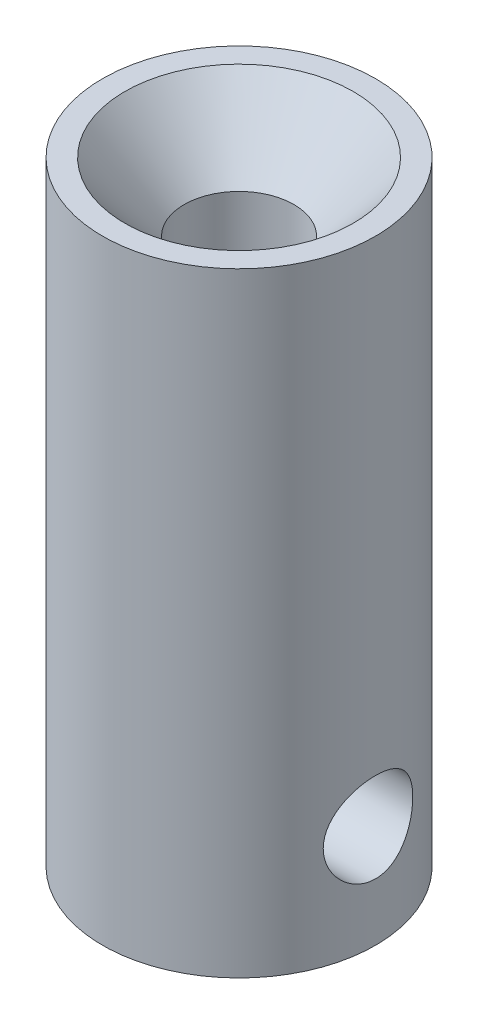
ISO-10303-21;
HEADER;
FILE_DESCRIPTION(('STEP AP214'),'2;1');
FILE_NAME('part.step','',(''),(''),'','','');
FILE_SCHEMA(('AUTOMOTIVE_DESIGN { 1 0 10303 214 1 1 1 1 }'));
ENDSEC;
DATA;
#1=APPLICATION_CONTEXT('core data for automotive mechanical design processes');
#2=APPLICATION_PROTOCOL_DEFINITION('international standard','automotive_design',2000,#1);
#3=PRODUCT_CONTEXT('',#1,'mechanical');
#4=PRODUCT('Part','Part','',(#3));
#5=PRODUCT_RELATED_PRODUCT_CATEGORY('part','',(#4));
#6=PRODUCT_DEFINITION_FORMATION('','',#4);
#7=PRODUCT_DEFINITION_CONTEXT('part definition',#1,'design');
#8=PRODUCT_DEFINITION('design','',#6,#7);
#9=PRODUCT_DEFINITION_SHAPE('','',#8);
#10=(LENGTH_UNIT() NAMED_UNIT(*) SI_UNIT(.MILLI.,.METRE.));
#11=(NAMED_UNIT(*) PLANE_ANGLE_UNIT() SI_UNIT($,.RADIAN.));
#12=(NAMED_UNIT(*) SI_UNIT($,.STERADIAN.) SOLID_ANGLE_UNIT());
#13=UNCERTAINTY_MEASURE_WITH_UNIT(LENGTH_MEASURE(1.E-05),#10,'distance_accuracy_value','');
#14=(GEOMETRIC_REPRESENTATION_CONTEXT(3) GLOBAL_UNCERTAINTY_ASSIGNED_CONTEXT((#13)) GLOBAL_UNIT_ASSIGNED_CONTEXT((#10,
#11,#12)) REPRESENTATION_CONTEXT('',''));
#15=CARTESIAN_POINT('',(0.,0.,0.));
#16=DIRECTION('',(0.,0.,1.));
#17=DIRECTION('',(1.,0.,0.));
#18=AXIS2_PLACEMENT_3D('',#15,#16,#17);
#19=CARTESIAN_POINT('',(0.,0.,0.));
#20=DIRECTION('',(0.,-1.,0.));
#21=DIRECTION('',(0.,0.,-1.));
#22=AXIS2_PLACEMENT_3D('',#19,#20,#21);
#23=CYLINDRICAL_SURFACE('',#22,2.5527);
#24=CARTESIAN_POINT('',(0.,19.05,0.));
#25=DIRECTION('',(0.,-1.,0.));
#26=DIRECTION('',(0.,0.,-1.));
#27=AXIS2_PLACEMENT_3D('',#24,#25,#26);
#28=CIRCLE('',#27,2.5527);
#29=CARTESIAN_POINT('',(0.,19.05,-2.5527));
#30=VERTEX_POINT('',#29);
#31=EDGE_CURVE('E37',#30,#30,#28,.T.);
#32=ORIENTED_EDGE('',*,*,#31,.F.);
#33=EDGE_LOOP('',(#32));
#34=FACE_BOUND('',#33,.T.);
#35=CARTESIAN_POINT('',(0.,-6.35000000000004,0.));
#36=DIRECTION('',(0.,-1.,0.));
#37=DIRECTION('',(0.,0.,-1.));
#38=AXIS2_PLACEMENT_3D('',#35,#36,#37);
#39=CIRCLE('',#38,2.55269999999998);
#40=CARTESIAN_POINT('',(0.,-6.35000000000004,-2.55269999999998));
#41=VERTEX_POINT('',#40);
#42=EDGE_CURVE('E53',#41,#41,#39,.T.);
#43=ORIENTED_EDGE('',*,*,#42,.T.);
#44=EDGE_LOOP('',(#43));
#45=FACE_BOUND('',#44,.T.);
#46=CARTESIAN_POINT('',(1.47587989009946,-1.5875,2.0828));
#47=CARTESIAN_POINT('',(1.47587121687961,-1.66365379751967,2.08280330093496));
#48=CARTESIAN_POINT('',(1.48188077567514,-1.73979375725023,2.07858463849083));
#49=CARTESIAN_POINT('',(1.50465790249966,-1.88965938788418,2.06215150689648));
#50=CARTESIAN_POINT('',(1.52145515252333,-1.96337780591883,2.04991497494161));
#51=CARTESIAN_POINT('',(1.57071313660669,-2.13318528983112,2.01255758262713));
#52=CARTESIAN_POINT('',(1.60666100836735,-2.22754536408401,1.98435507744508));
#53=CARTESIAN_POINT('',(1.68686059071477,-2.40841287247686,1.91664795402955));
#54=CARTESIAN_POINT('',(1.73113719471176,-2.49489558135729,1.87710926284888));
#55=CARTESIAN_POINT('',(1.80942766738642,-2.63539548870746,1.80118782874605));
#56=CARTESIAN_POINT('',(1.84253277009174,-2.69136568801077,1.76742017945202));
#57=CARTESIAN_POINT('',(1.90937588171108,-2.79965087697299,1.69499092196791));
#58=CARTESIAN_POINT('',(1.94311413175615,-2.85196443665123,1.65632741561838));
#59=CARTESIAN_POINT('',(2.04374672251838,-3.00326503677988,1.53315702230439));
#60=CARTESIAN_POINT('',(2.11019009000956,-3.0968335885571,1.44135003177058));
#61=CARTESIAN_POINT('',(2.22238594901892,-3.24967957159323,1.25947685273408));
#62=CARTESIAN_POINT('',(2.26959140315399,-3.31205669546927,1.17289209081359));
#63=CARTESIAN_POINT('',(2.35585772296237,-3.42410797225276,0.988202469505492));
#64=CARTESIAN_POINT('',(2.39493160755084,-3.47380245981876,0.8901164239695));
#65=CARTESIAN_POINT('',(2.45616224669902,-3.55090487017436,0.701210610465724));
#66=CARTESIAN_POINT('',(2.4800543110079,-3.5806485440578,0.611912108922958));
#67=CARTESIAN_POINT('',(2.51827909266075,-3.62801616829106,0.428170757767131));
#68=CARTESIAN_POINT('',(2.53261712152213,-3.64564685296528,0.333730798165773));
#69=CARTESIAN_POINT('',(2.55057705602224,-3.66770756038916,0.1419226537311));
#70=CARTESIAN_POINT('',(2.55415827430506,-3.67208746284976,0.0445447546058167));
#71=CARTESIAN_POINT('',(2.55016005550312,-3.66718676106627,-0.149633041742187));
#72=CARTESIAN_POINT('',(2.54258058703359,-3.65790611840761,-0.246432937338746));
#73=CARTESIAN_POINT('',(2.51772562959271,-3.62730236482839,-0.430650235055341));
#74=CARTESIAN_POINT('',(2.5010632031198,-3.60674019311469,-0.518281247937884));
#75=CARTESIAN_POINT('',(2.45968277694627,-3.55525301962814,-0.688411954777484));
#76=CARTESIAN_POINT('',(2.43496267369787,-3.52432531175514,-0.770910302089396));
#77=CARTESIAN_POINT('',(2.37638181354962,-3.45016864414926,-0.936758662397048));
#78=CARTESIAN_POINT('',(2.3418909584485,-3.40607205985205,-1.01949376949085));
#79=CARTESIAN_POINT('',(2.26711072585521,-3.30870345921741,-1.17645992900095));
#80=CARTESIAN_POINT('',(2.22681860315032,-3.25542709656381,-1.25068692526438));
#81=CARTESIAN_POINT('',(2.13366530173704,-3.12909062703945,-1.40479282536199));
#82=CARTESIAN_POINT('',(2.07992996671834,-3.05421876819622,-1.48265405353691));
#83=CARTESIAN_POINT('',(1.97035027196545,-2.89420587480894,-1.62545456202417));
#84=CARTESIAN_POINT('',(1.91450298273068,-2.80905018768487,-1.69037504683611));
#85=CARTESIAN_POINT('',(1.80747203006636,-2.63315541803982,-1.80419595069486));
#86=CARTESIAN_POINT('',(1.75619274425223,-2.54287139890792,-1.85370919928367));
#87=CARTESIAN_POINT('',(1.66054051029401,-2.35293665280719,-1.93984364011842));
#88=CARTESIAN_POINT('',(1.61615257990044,-2.25330702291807,-1.97649302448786));
#89=CARTESIAN_POINT('',(1.55471574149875,-2.0804341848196,-2.02487476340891));
#90=CARTESIAN_POINT('',(1.53351371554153,-2.00988814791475,-2.04084174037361));
#91=CARTESIAN_POINT('',(1.50020332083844,-1.86550702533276,-2.06545465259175));
#92=CARTESIAN_POINT('',(1.48807259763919,-1.79168050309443,-2.07411859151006));
#93=CARTESIAN_POINT('',(1.47499151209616,-1.64189833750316,-2.08344805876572));
#94=CARTESIAN_POINT('',(1.4741281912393,-1.56593065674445,-2.08405131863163));
#95=CARTESIAN_POINT('',(1.48399730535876,-1.41510873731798,-2.07703059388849));
#96=CARTESIAN_POINT('',(1.4947436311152,-1.34025594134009,-2.06939675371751));
#97=CARTESIAN_POINT('',(1.52907011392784,-1.1783884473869,-2.04419905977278));
#98=CARTESIAN_POINT('',(1.55488114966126,-1.09214333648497,-2.02487872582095));
#99=CARTESIAN_POINT('',(1.61561301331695,-0.925641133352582,-1.97675542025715));
#100=CARTESIAN_POINT('',(1.65056225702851,-0.845403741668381,-1.94792279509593));
#101=CARTESIAN_POINT('',(1.71654890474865,-0.709466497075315,-1.88975980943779));
#102=CARTESIAN_POINT('',(1.74653376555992,-0.65247586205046,-1.86218545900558));
#103=CARTESIAN_POINT('',(1.80815126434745,-0.541892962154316,-1.80241868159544));
#104=CARTESIAN_POINT('',(1.83978468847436,-0.488302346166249,-1.77022403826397));
#105=CARTESIAN_POINT('',(1.93562249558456,-0.332435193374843,-1.66686560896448));
#106=CARTESIAN_POINT('',(2.00074848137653,-0.235093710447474,-1.58894051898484));
#107=CARTESIAN_POINT('',(2.12854894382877,-0.0523102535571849,-1.41339548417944));
#108=CARTESIAN_POINT('',(2.19112600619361,0.0327869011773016,-1.31534470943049));
#109=CARTESIAN_POINT('',(2.30612645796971,0.185204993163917,-1.10122932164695));
#110=CARTESIAN_POINT('',(2.35858093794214,0.252580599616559,-0.985221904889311));
#111=CARTESIAN_POINT('',(2.43343966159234,0.347430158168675,-0.776408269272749));
#112=CARTESIAN_POINT('',(2.46010587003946,0.380788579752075,-0.687788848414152));
#113=CARTESIAN_POINT('',(2.50407824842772,0.435481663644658,-0.504681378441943));
#114=CARTESIAN_POINT('',(2.52139161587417,0.456825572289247,-0.410197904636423));
#115=CARTESIAN_POINT('',(2.54529268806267,0.486232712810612,-0.217352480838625));
#116=CARTESIAN_POINT('',(2.55182890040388,0.494232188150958,-0.118974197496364));
#117=CARTESIAN_POINT('',(2.55340678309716,0.496166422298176,0.0780135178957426));
#118=CARTESIAN_POINT('',(2.54844971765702,0.490102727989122,0.176622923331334));
#119=CARTESIAN_POINT('',(2.52828425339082,0.465314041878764,0.363682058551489));
#120=CARTESIAN_POINT('',(2.51385131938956,0.447546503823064,0.452347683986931));
#121=CARTESIAN_POINT('',(2.4765863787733,0.401330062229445,0.624982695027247));
#122=CARTESIAN_POINT('',(2.45375160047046,0.37287763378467,0.70895052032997));
#123=CARTESIAN_POINT('',(2.3992224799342,0.304196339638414,0.876543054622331));
#124=CARTESIAN_POINT('',(2.36700873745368,0.263267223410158,0.959708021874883));
#125=CARTESIAN_POINT('',(2.29651637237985,0.172214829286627,1.11794515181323));
#126=CARTESIAN_POINT('',(2.25823769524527,0.12209146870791,1.19301724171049));
#127=CARTESIAN_POINT('',(2.16954764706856,0.00327981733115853,1.34865212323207));
#128=CARTESIAN_POINT('',(2.11823137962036,-0.0671206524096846,1.42738566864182));
#129=CARTESIAN_POINT('',(2.01265241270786,-0.218015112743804,1.57276570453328));
#130=CARTESIAN_POINT('',(1.95838099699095,-0.298539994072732,1.63937360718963));
#131=CARTESIAN_POINT('',(1.87167825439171,-0.435732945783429,1.73653174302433));
#132=CARTESIAN_POINT('',(1.83897118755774,-0.489481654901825,1.77102331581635));
#133=CARTESIAN_POINT('',(1.77487592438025,-0.600571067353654,1.83525152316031));
#134=CARTESIAN_POINT('',(1.74348848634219,-0.657913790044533,1.86498545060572));
#135=CARTESIAN_POINT('',(1.68346080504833,-0.776081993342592,1.91934113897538));
#136=CARTESIAN_POINT('',(1.65481149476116,-0.836894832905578,1.94398011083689));
#137=CARTESIAN_POINT('',(1.60187292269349,-0.962202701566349,1.98782809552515));
#138=CARTESIAN_POINT('',(1.57757817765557,-1.02669296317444,2.00704395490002));
#139=CARTESIAN_POINT('',(1.53152936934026,-1.17168313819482,2.04247278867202));
#140=CARTESIAN_POINT('',(1.51108803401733,-1.25292997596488,2.05746273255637));
#141=CARTESIAN_POINT('',(1.48329559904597,-1.41863356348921,2.07760383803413));
#142=CARTESIAN_POINT('',(1.47588950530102,-1.5030752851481,2.08279634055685));
#143=CARTESIAN_POINT('',(1.47587989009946,-1.5875,2.0828));
#144=B_SPLINE_CURVE_WITH_KNOTS('',3,(#46,#47,#48,#49,#50,#51,#52,#53,#54,#55,#56,#57,#58,#59,
#60,#61,#62,#63,#64,#65,#66,#67,#68,#69,#70,#71,#72,#73,#74,#75,#76,#77,#78,#79,#80,#81,#82,#83,
#84,#85,#86,#87,#88,#89,#90,#91,#92,#93,#94,#95,#96,#97,#98,#99,#100,#101,#102,#103,#104,#105,
#106,#107,#108,#109,#110,#111,#112,#113,#114,#115,#116,#117,#118,#119,#120,#121,#122,#123,#124,
#125,#126,#127,#128,#129,#130,#131,#132,#133,#134,#135,#136,#137,#138,#139,#140,#141,#142,#143),
.UNSPECIFIED.,.T.,.F.,(4,2,2,2,2,2,2,2,2,2,2,2,2,2,2,2,2,2,2,2,2,2,2,2,2,2,2,2,2,2,2,2,2,2,2,2,
2,2,2,2,2,2,2,2,2,2,2,2,4),(0.,0.228125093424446,0.45688057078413,0.769661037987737,
1.08339165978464,1.30295131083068,1.52259634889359,1.96104367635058,2.30985265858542,
2.65809881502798,2.94819861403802,3.23813699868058,3.52917069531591,3.82020521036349,
4.09366750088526,4.36720123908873,4.66580430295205,4.96454913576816,5.32521827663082,
5.68640750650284,6.03050054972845,6.37383470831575,6.59918965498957,6.82398741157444,
7.05052072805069,7.27732538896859,7.55202348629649,7.82758614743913,8.03748058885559,
8.24747605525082,8.66757592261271,9.09783826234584,9.52675729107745,9.82070158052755,
10.1144193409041,10.4095364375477,10.7046210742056,10.9781456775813,11.2517605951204,
11.54507024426,11.8383825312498,12.1894461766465,12.541608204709,12.7566471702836,
12.9718080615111,13.1862298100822,13.4003796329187,13.6543550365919,13.9072563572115),.UNSPECIFIED.);
#145=CARTESIAN_POINT('',(1.47587989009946,-1.5875,2.0828));
#146=VERTEX_POINT('',#145);
#147=EDGE_CURVE('E56',#146,#146,#144,.T.);
#148=ORIENTED_EDGE('',*,*,#147,.T.);
#149=EDGE_LOOP('',(#148));
#150=FACE_BOUND('',#149,.T.);
#151=ADVANCED_FACE('F26',(#34,#45,#150),#23,.F.);
#152=CARTESIAN_POINT('',(0.,0.,0.));
#153=DIRECTION('',(0.,-1.,0.));
#154=DIRECTION('',(0.,0.,-1.));
#155=AXIS2_PLACEMENT_3D('',#152,#153,#154);
#156=CYLINDRICAL_SURFACE('',#155,6.35);
#157=CARTESIAN_POINT('',(0.,22.225,0.));
#158=DIRECTION('',(0.,-1.,0.));
#159=DIRECTION('',(0.,0.,-1.));
#160=AXIS2_PLACEMENT_3D('',#157,#158,#159);
#161=CIRCLE('',#160,6.35);
#162=CARTESIAN_POINT('',(0.,22.225,-6.35));
#163=VERTEX_POINT('',#162);
#164=EDGE_CURVE('E45',#163,#163,#161,.T.);
#165=ORIENTED_EDGE('',*,*,#164,.T.);
#166=EDGE_LOOP('',(#165));
#167=FACE_BOUND('',#166,.T.);
#168=CARTESIAN_POINT('',(0.,-6.35,0.));
#169=DIRECTION('',(0.,-1.,0.));
#170=DIRECTION('',(0.,0.,-1.));
#171=AXIS2_PLACEMENT_3D('',#168,#169,#170);
#172=CIRCLE('',#171,6.35);
#173=CARTESIAN_POINT('',(0.,-6.35,-6.35));
#174=VERTEX_POINT('',#173);
#175=EDGE_CURVE('E50',#174,#174,#172,.T.);
#176=ORIENTED_EDGE('',*,*,#175,.F.);
#177=EDGE_LOOP('',(#176));
#178=FACE_BOUND('',#177,.T.);
#179=CARTESIAN_POINT('',(6.35,-3.6703,0.));
#180=CARTESIAN_POINT('',(6.35000006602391,-3.67030017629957,0.113746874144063));
#181=CARTESIAN_POINT('',(6.34691533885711,-3.66095158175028,0.227493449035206));
#182=CARTESIAN_POINT('',(6.33491317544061,-3.62391433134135,0.451642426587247));
#183=CARTESIAN_POINT('',(6.32599494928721,-3.59622319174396,0.56204437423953));
#184=CARTESIAN_POINT('',(6.30329619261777,-3.52354779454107,0.776240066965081));
#185=CARTESIAN_POINT('',(6.28952363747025,-3.47859189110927,0.880044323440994));
#186=CARTESIAN_POINT('',(6.25852622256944,-3.37278929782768,1.07864011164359));
#187=CARTESIAN_POINT('',(6.24130071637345,-3.3119396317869,1.17342995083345));
#188=CARTESIAN_POINT('',(6.2045658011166,-3.17392433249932,1.3544970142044));
#189=CARTESIAN_POINT('',(6.18500295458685,-3.09631968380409,1.44042870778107));
#190=CARTESIAN_POINT('',(6.14609620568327,-2.92793106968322,1.59831996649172));
#191=CARTESIAN_POINT('',(6.12675235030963,-2.83714433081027,1.67027658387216));
#192=CARTESIAN_POINT('',(6.0898896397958,-2.64188924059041,1.80012146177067));
#193=CARTESIAN_POINT('',(6.07243612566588,-2.53711172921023,1.85756515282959));
#194=CARTESIAN_POINT('',(6.04214046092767,-2.31871819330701,1.95386950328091));
#195=CARTESIAN_POINT('',(6.02929695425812,-2.2051047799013,1.99273562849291));
#196=CARTESIAN_POINT('',(6.0102372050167,-1.97618607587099,2.04949365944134));
#197=CARTESIAN_POINT('',(6.00381751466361,-1.86105833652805,2.06803135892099));
#198=CARTESIAN_POINT('',(5.99772989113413,-1.62916143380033,2.08562484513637));
#199=CARTESIAN_POINT('',(5.99805994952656,-1.51239276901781,2.08468642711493));
#200=CARTESIAN_POINT('',(6.00525590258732,-1.28599229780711,2.06385669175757));
#201=CARTESIAN_POINT('',(6.01183316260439,-1.17627273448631,2.04480233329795));
#202=CARTESIAN_POINT('',(6.03031102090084,-0.961683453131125,1.9896447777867));
#203=CARTESIAN_POINT('',(6.04221223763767,-0.856814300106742,1.95353959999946));
#204=CARTESIAN_POINT('',(6.07020673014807,-0.652977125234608,1.86474625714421));
#205=CARTESIAN_POINT('',(6.08636298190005,-0.554127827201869,1.81180625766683));
#206=CARTESIAN_POINT('',(6.12102011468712,-0.366448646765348,1.69102087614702));
#207=CARTESIAN_POINT('',(6.13952165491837,-0.277621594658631,1.62317129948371));
#208=CARTESIAN_POINT('',(6.1779261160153,-0.107797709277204,1.47045022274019));
#209=CARTESIAN_POINT('',(6.19785264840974,-0.0274219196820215,1.38489270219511));
#210=CARTESIAN_POINT('',(6.23604367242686,0.118000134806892,1.20126705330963));
#211=CARTESIAN_POINT('',(6.25430801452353,0.183045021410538,1.10319780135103));
#212=CARTESIAN_POINT('',(6.28734344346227,0.296437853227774,0.896046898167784));
#213=CARTESIAN_POINT('',(6.30208031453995,0.344624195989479,0.786870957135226));
#214=CARTESIAN_POINT('',(6.32615238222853,0.421756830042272,0.561364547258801));
#215=CARTESIAN_POINT('',(6.33548939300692,0.450709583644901,0.445036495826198));
#216=CARTESIAN_POINT('',(6.34741142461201,0.487464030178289,0.213789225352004));
#217=CARTESIAN_POINT('',(6.35026429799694,0.496105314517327,0.0990170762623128));
#218=CARTESIAN_POINT('',(6.34969703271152,0.494376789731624,-0.130357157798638));
#219=CARTESIAN_POINT('',(6.34627791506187,0.484010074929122,-0.24495926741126));
#220=CARTESIAN_POINT('',(6.33372746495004,0.445226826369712,-0.467411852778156));
#221=CARTESIAN_POINT('',(6.32475802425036,0.417321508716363,-0.575361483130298));
#222=CARTESIAN_POINT('',(6.3021734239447,0.344888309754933,-0.785006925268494));
#223=CARTESIAN_POINT('',(6.28855767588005,0.300358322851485,-0.886701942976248));
#224=CARTESIAN_POINT('',(6.25762987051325,0.194661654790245,-1.08387791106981));
#225=CARTESIAN_POINT('',(6.24023141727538,0.133094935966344,-1.17913048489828));
#226=CARTESIAN_POINT('',(6.20371543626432,-0.00445502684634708,-1.35822773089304));
#227=CARTESIAN_POINT('',(6.18459739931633,-0.0804425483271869,-1.44206900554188));
#228=CARTESIAN_POINT('',(6.14573465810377,-0.248626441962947,-1.59979296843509));
#229=CARTESIAN_POINT('',(6.12599930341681,-0.341388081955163,-1.67307663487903));
#230=CARTESIAN_POINT('',(6.08899771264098,-0.538317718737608,-1.80310631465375));
#231=CARTESIAN_POINT('',(6.07173147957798,-0.642485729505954,-1.85985230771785));
#232=CARTESIAN_POINT('',(6.0417989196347,-0.859241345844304,-1.95490603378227));
#233=CARTESIAN_POINT('',(6.02912081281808,-0.971806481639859,-1.99326106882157));
#234=CARTESIAN_POINT('',(6.0099634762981,-1.20230695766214,-2.05030783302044));
#235=CARTESIAN_POINT('',(6.00348157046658,-1.32023995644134,-2.06900805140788));
#236=CARTESIAN_POINT('',(5.99774832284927,-1.55181412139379,-2.08556553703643));
#237=CARTESIAN_POINT('',(5.99815313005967,-1.66537671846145,-2.08441395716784));
#238=CARTESIAN_POINT('',(6.00530141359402,-1.89060141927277,-2.06372767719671));
#239=CARTESIAN_POINT('',(6.01204453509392,-2.00226362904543,-2.04419400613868));
#240=CARTESIAN_POINT('',(6.03085764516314,-2.2185467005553,-1.98799000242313));
#241=CARTESIAN_POINT('',(6.04283069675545,-2.3232575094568,-1.95163083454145));
#242=CARTESIAN_POINT('',(6.07072158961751,-2.52517380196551,-1.86305801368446));
#243=CARTESIAN_POINT('',(6.08664028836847,-2.62237764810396,-1.81084091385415));
#244=CARTESIAN_POINT('',(6.12147208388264,-2.81099496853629,-1.68944453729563));
#245=CARTESIAN_POINT('',(6.14048365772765,-2.90198704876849,-1.6196389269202));
#246=CARTESIAN_POINT('',(6.17893635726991,-3.07128614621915,-1.46611713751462));
#247=CARTESIAN_POINT('',(6.19837760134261,-3.14958961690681,-1.3823970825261));
#248=CARTESIAN_POINT('',(6.23636904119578,-3.29422586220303,-1.19967311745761));
#249=CARTESIAN_POINT('',(6.25485900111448,-3.36000355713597,-1.10021578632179));
#250=CARTESIAN_POINT('',(6.28806102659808,-3.47383043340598,-0.891054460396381));
#251=CARTESIAN_POINT('',(6.30277419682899,-3.5218848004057,-0.781353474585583));
#252=CARTESIAN_POINT('',(6.32608129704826,-3.59649170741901,-0.56105052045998));
#253=CARTESIAN_POINT('',(6.33496786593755,-3.62408360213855,-0.450831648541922));
#254=CARTESIAN_POINT('',(6.34692644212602,-3.66098532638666,-0.227074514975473));
#255=CARTESIAN_POINT('',(6.34999993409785,-3.67029982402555,-0.113537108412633));
#256=CARTESIAN_POINT('',(6.35,-3.6703,0.));
#257=B_SPLINE_CURVE_WITH_KNOTS('',3,(#179,#180,#181,#182,#183,#184,#185,#186,#187,#188,#189,
#190,#191,#192,#193,#194,#195,#196,#197,#198,#199,#200,#201,#202,#203,#204,#205,#206,#207,#208,
#209,#210,#211,#212,#213,#214,#215,#216,#217,#218,#219,#220,#221,#222,#223,#224,#225,#226,#227,
#228,#229,#230,#231,#232,#233,#234,#235,#236,#237,#238,#239,#240,#241,#242,#243,#244,#245,#246,
#247,#248,#249,#250,#251,#252,#253,#254,#255,#256),.UNSPECIFIED.,.T.,.F.,(4,2,2,2,2,2,2,2,2,2,2,
2,2,2,2,2,2,2,2,2,2,2,2,2,2,2,2,2,2,2,2,2,2,2,2,2,2,2,4),(0.,0.340822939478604,
0.681692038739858,1.02200370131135,1.36237913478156,1.71308161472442,2.06385798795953,
2.42434434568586,2.78472457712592,3.1332911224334,3.4817539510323,3.81486218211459,
4.14800911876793,4.48639468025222,4.82487556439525,5.18043132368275,5.53601903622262,
5.89492751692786,6.25371534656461,6.59738962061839,6.94100795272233,7.27504751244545,
7.60912939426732,7.95184111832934,8.29465465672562,8.65252285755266,9.01039149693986,
9.36733468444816,9.72412363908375,10.0631529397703,10.4021632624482,10.7351402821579,
11.0681897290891,11.4153873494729,11.7626818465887,12.1229232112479,12.48305908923,
12.8233404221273,13.1635348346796),.UNSPECIFIED.);
#258=CARTESIAN_POINT('',(6.35,-3.6703,0.));
#259=VERTEX_POINT('',#258);
#260=EDGE_CURVE('E10',#259,#259,#257,.T.);
#261=ORIENTED_EDGE('',*,*,#260,.T.);
#262=EDGE_LOOP('',(#261));
#263=FACE_BOUND('',#262,.T.);
#264=ADVANCED_FACE('F70',(#167,#178,#263),#156,.T.);
#265=CARTESIAN_POINT('',(0.,22.225,0.));
#266=DIRECTION('',(0.,1.,0.));
#267=DIRECTION('',(0.,0.,1.));
#268=AXIS2_PLACEMENT_3D('',#265,#266,#267);
#269=CONICAL_SURFACE('',#268,5.31268539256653,0.715584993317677);
#270=ORIENTED_EDGE('',*,*,#31,.T.);
#271=EDGE_LOOP('',(#270));
#272=FACE_BOUND('',#271,.T.);
#273=CARTESIAN_POINT('',(0.,22.225,0.));
#274=DIRECTION('',(0.,-1.,0.));
#275=DIRECTION('',(0.,0.,-1.));
#276=AXIS2_PLACEMENT_3D('',#273,#274,#275);
#277=CIRCLE('',#276,5.31268539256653);
#278=CARTESIAN_POINT('',(0.,22.225,-5.31268539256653));
#279=VERTEX_POINT('',#278);
#280=EDGE_CURVE('E41',#279,#279,#277,.T.);
#281=ORIENTED_EDGE('',*,*,#280,.F.);
#282=EDGE_LOOP('',(#281));
#283=FACE_BOUND('',#282,.T.);
#284=ADVANCED_FACE('F74',(#272,#283),#269,.F.);
#285=CARTESIAN_POINT('',(5.31268539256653,22.225,0.));
#286=DIRECTION('',(0.,1.,0.));
#287=DIRECTION('',(0.,0.,1.));
#288=AXIS2_PLACEMENT_3D('',#285,#286,#287);
#289=PLANE('',#288);
#290=ORIENTED_EDGE('',*,*,#280,.T.);
#291=EDGE_LOOP('',(#290));
#292=FACE_BOUND('',#291,.T.);
#293=ORIENTED_EDGE('',*,*,#164,.F.);
#294=EDGE_LOOP('',(#293));
#295=FACE_BOUND('',#294,.T.);
#296=ADVANCED_FACE('F68',(#292,#295),#289,.T.);
#297=CARTESIAN_POINT('',(6.35,-6.35,0.));
#298=DIRECTION('',(0.,-1.,0.));
#299=DIRECTION('',(0.,0.,-1.));
#300=AXIS2_PLACEMENT_3D('',#297,#298,#299);
#301=PLANE('',#300);
#302=ORIENTED_EDGE('',*,*,#175,.T.);
#303=EDGE_LOOP('',(#302));
#304=FACE_BOUND('',#303,.T.);
#305=ORIENTED_EDGE('',*,*,#42,.F.);
#306=EDGE_LOOP('',(#305));
#307=FACE_BOUND('',#306,.T.);
#308=ADVANCED_FACE('F64',(#304,#307),#301,.T.);
#309=CARTESIAN_POINT('',(6.35,-1.5875,0.));
#310=DIRECTION('',(-1.,0.,0.));
#311=DIRECTION('',(0.,0.,1.));
#312=AXIS2_PLACEMENT_3D('',#309,#310,#311);
#313=CYLINDRICAL_SURFACE('',#312,2.0828);
#314=ORIENTED_EDGE('',*,*,#147,.F.);
#315=EDGE_LOOP('',(#314));
#316=FACE_BOUND('',#315,.T.);
#317=ORIENTED_EDGE('',*,*,#260,.F.);
#318=EDGE_LOOP('',(#317));
#319=FACE_BOUND('',#318,.T.);
#320=ADVANCED_FACE('F60',(#316,#319),#313,.F.);
#321=CLOSED_SHELL('',(#151,#264,#284,#296,#308,#320));
#322=MANIFOLD_SOLID_BREP('B2',#321);
#323=ADVANCED_BREP_SHAPE_REPRESENTATION('',(#18,#322),#14);
#324=SHAPE_DEFINITION_REPRESENTATION(#9,#323);
ENDSEC;
END-ISO-10303-21;
